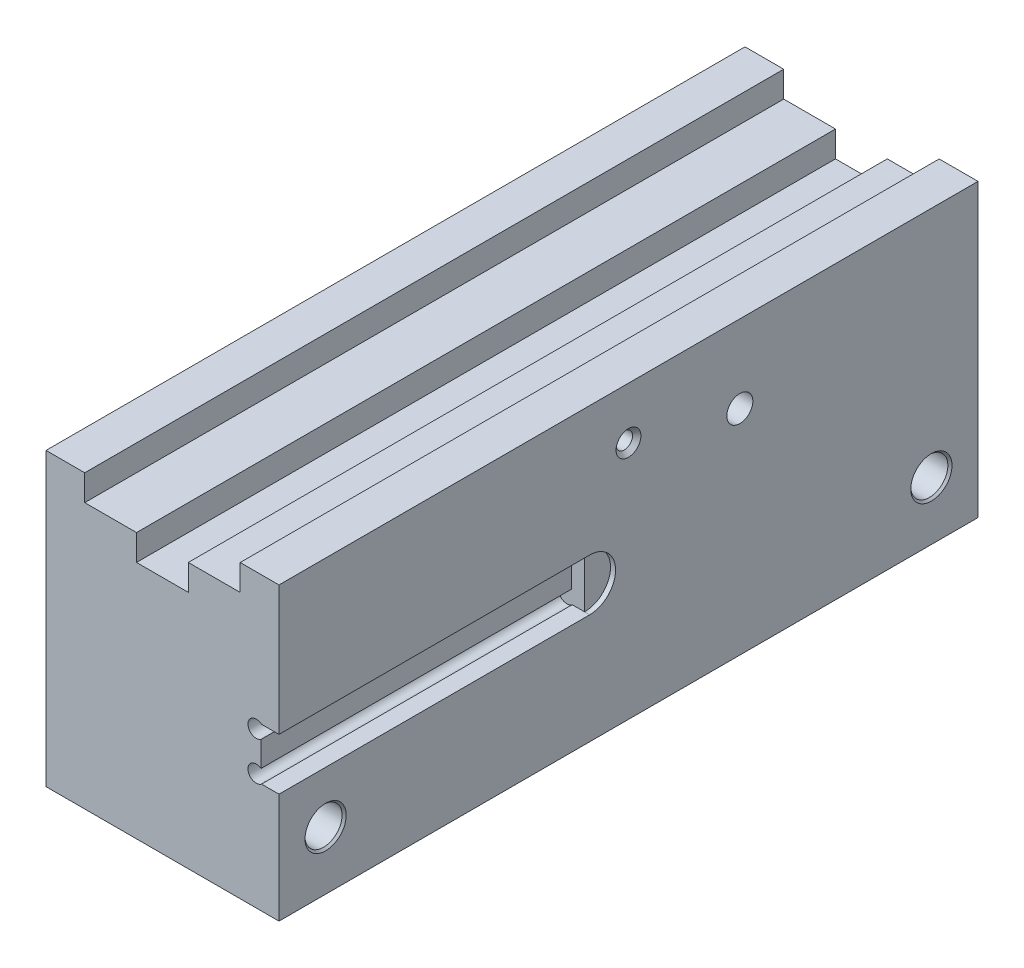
from build123d import *

# Parameters (mm, degrees)
SKETCH1_W                              = 57.15
SKETCH1_H                              = 71.4248
BOSS_EXTRUDE1_DEPTH                    = 171.45
CUT_EXTRUDE1_DEPTH                     = 195.32634164
SKETCH3_R                              = 3.2004
CUT_EXTRUDE2_DEPTH                     = 6.35
F_1_4_20_TAPPED_HOLE1_D                = 5.1054
F_1_4_20_TAPPED_HOLE1_DEPTH            = 11.43
F_1_4_20_TAPPED_HOLE1_CSINK_D          = 7.62
F_1_4_20_TAPPED_HOLE1_CSINK_ANGLE      = 90
F_1_4_20_TAPPED_HOLE1_TIP              = 1.533816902
CUT_EXTRUDE4_DEPTH                     = 76.2
SKETCH10_R                             = 6.35
CUT_EXTRUDE5_DEPTH                     = 1.2319
SKETCH11_R                             = 4.3561
CUT_EXTRUDE6_DEPTH                     = 11.0998
F_1_8_27_NPSM_TAPPED_HOLE1_D           = 9.0932
F_1_8_27_NPSM_TAPPED_HOLE1_DEPTH       = 22.86
F_1_8_27_NPSM_TAPPED_HOLE1_CSINK_D     = 10.1092
F_1_8_27_NPSM_TAPPED_HOLE1_CSINK_ANGLE = 90
F_1_8_27_NPSM_TAPPED_HOLE1_TIP         = 2.73187289
F_1_8_27_NPSM_TAPPED_HOLE2_D           = 9.0932
F_1_8_27_NPSM_TAPPED_HOLE2_DEPTH       = 22.86
F_1_8_27_NPSM_TAPPED_HOLE2_CSINK_D     = 10.1092
F_1_8_27_NPSM_TAPPED_HOLE2_CSINK_ANGLE = 90
F_1_8_27_NPSM_TAPPED_HOLE2_TIP         = 2.73187289
SKETCH16_R                             = 3.19405
CUT_EXTRUDE7_DEPTH                     = 11.0998
F_10_32_TAPPED_HOLE2_D                 = 4.0386
F_10_32_TAPPED_HOLE2_DEPTH             = 11.938
F_10_32_TAPPED_HOLE2_CSINK_D           = 6.096
F_10_32_TAPPED_HOLE2_CSINK_ANGLE       = 90
F_10_32_TAPPED_HOLE2_TIP               = 1.213317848


with BuildPart() as part:
    # Sketch1 → Boss-Extrude1 (new body)
    with BuildSketch(Plane.XY):
        with Locations((28.575, 35.7124)):
            Rectangle(SKETCH1_W, SKETCH1_H)
    extrude(amount=-BOSS_EXTRUDE1_DEPTH)

    # Sketch2 → Cut-Extrude1 (cut, through all)
    with BuildSketch(Plane.XY):
        Polygon((9.4996, 71.4248), (47.625, 71.4248), (47.625, 65.0748), (34.8996, 65.0748), (34.8996, 58.7248), (22.1996, 58.7248), (22.1996, 65.0748), (9.4996, 65.0748), align=None)
    extrude(amount=-CUT_EXTRUDE1_DEPTH, mode=Mode.SUBTRACT)

    # Sketch3 → Cut-Extrude2 (cut)
    with BuildSketch(Plane.XZ):
        with Locations(Location((26.9875, -34.925, 0), (0, 0, 270))):
            Circle(SKETCH3_R)
        with Locations(Location((7.9375, -85.725, 0), (0, 0, 270))):
            Circle(SKETCH3_R)
        with Locations(Location((46.0375, -85.725, 0), (0, 0, 270))):
            Circle(SKETCH3_R)
        with Locations(Location((26.9875, -136.525, 0), (0, 0, 270))):
            Circle(SKETCH3_R)
    extrude(amount=-CUT_EXTRUDE2_DEPTH, mode=Mode.SUBTRACT)

    # 1_4-20 Tapped Hole1
    with Locations(Plane(origin=(0, 0, 0), x_dir=(-1, 0, 0), z_dir=(0, -1, 0))):
        with Locations((-7.9375, 60.325), (-46.0375, 60.325), (-46.0375, 111.125), (-7.9375, 111.125)):
            CounterSinkHole(F_1_4_20_TAPPED_HOLE1_D / 2, F_1_4_20_TAPPED_HOLE1_CSINK_D / 2, depth=F_1_4_20_TAPPED_HOLE1_DEPTH, counter_sink_angle=F_1_4_20_TAPPED_HOLE1_CSINK_ANGLE)
            with Locations((0, 0, -(F_1_4_20_TAPPED_HOLE1_DEPTH + F_1_4_20_TAPPED_HOLE1_TIP / 2))):  # 118° drill point
                Cone(0, F_1_4_20_TAPPED_HOLE1_D / 2, F_1_4_20_TAPPED_HOLE1_TIP, mode=Mode.SUBTRACT)

    # Sketch9 → Cut-Extrude4 (cut)
    with BuildSketch(Plane.XY):
        with BuildLine():
            Line((52.863358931, 39.6748), (57.15, 39.6748))
            Line((57.15, 39.6748), (57.15, 26.9748))
            Line((57.15, 26.9748), (52.863358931, 26.9748))
            ThreePointArc((52.863358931, 26.9748), (49.53138515, 28.487050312), (52.7431, 30.240286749))
            Line((52.7431, 30.240286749), (52.7431, 36.409313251))
            ThreePointArc((52.7431, 36.409313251), (49.53138515, 38.162549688), (52.863358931, 39.6748))
        make_face()
    extrude(amount=-CUT_EXTRUDE4_DEPTH, mode=Mode.SUBTRACT)

    # Sketch10 → Cut-Extrude5 (cut)
    with BuildSketch(Plane(origin=(57.15, 0, 0), x_dir=(0, 0, -1), z_dir=(1, 0, 0))):
        with Locations((76.2, 33.3248)):
            Circle(SKETCH10_R)
    extrude(amount=-CUT_EXTRUDE5_DEPTH, mode=Mode.SUBTRACT)

    # Sketch11 → Cut-Extrude6 (cut)
    with BuildSketch(Plane.XZ):
        with Locations(Location((26.9875, -11.43, 0), (0, 0, 270))):
            Circle(SKETCH11_R)
        with Locations(Location((26.9875, -160.02, 0), (0, 0, 270))):
            Circle(SKETCH11_R)
    extrude(amount=-CUT_EXTRUDE6_DEPTH, mode=Mode.SUBTRACT)

    # 1_8-27 NPSM Tapped Hole1
    with Locations(Plane(origin=(0, 0, 0), x_dir=(-1, 0, 0), z_dir=(0, -1, 0))):
        with Locations((-26.9875, 11.43), (-26.9875, 160.02)):
            CounterSinkHole(F_1_8_27_NPSM_TAPPED_HOLE1_D / 2, F_1_8_27_NPSM_TAPPED_HOLE1_CSINK_D / 2, depth=F_1_8_27_NPSM_TAPPED_HOLE1_DEPTH, counter_sink_angle=F_1_8_27_NPSM_TAPPED_HOLE1_CSINK_ANGLE)
            with Locations((0, 0, -(F_1_8_27_NPSM_TAPPED_HOLE1_DEPTH + F_1_8_27_NPSM_TAPPED_HOLE1_TIP / 2))):  # 118° drill point
                Cone(0, F_1_8_27_NPSM_TAPPED_HOLE1_D / 2, F_1_8_27_NPSM_TAPPED_HOLE1_TIP, mode=Mode.SUBTRACT)

    # 1_8-27 NPSM Tapped Hole2
    with Locations(Plane(origin=(57.15, 0, 0), x_dir=(0, 0, -1), z_dir=(1, 0, 0))):
        with Locations((11.43, 14.2748), (160.02, 14.2748)):
            CounterSinkHole(F_1_8_27_NPSM_TAPPED_HOLE2_D / 2, F_1_8_27_NPSM_TAPPED_HOLE2_CSINK_D / 2, depth=F_1_8_27_NPSM_TAPPED_HOLE2_DEPTH, counter_sink_angle=F_1_8_27_NPSM_TAPPED_HOLE2_CSINK_ANGLE)
            with Locations((0, 0, -(F_1_8_27_NPSM_TAPPED_HOLE2_DEPTH + F_1_8_27_NPSM_TAPPED_HOLE2_TIP / 2))):  # 118° drill point
                Cone(0, F_1_8_27_NPSM_TAPPED_HOLE2_D / 2, F_1_8_27_NPSM_TAPPED_HOLE2_TIP, mode=Mode.SUBTRACT)

    # Sketch16 → Cut-Extrude7 (cut)
    with BuildSketch(Plane(origin=(57.15, 0, 0), x_dir=(0, 0, -1), z_dir=(1, 0, 0))):
        with Locations((113.03, 52.3748)):
            Circle(SKETCH16_R)
    extrude(amount=-CUT_EXTRUDE7_DEPTH, mode=Mode.SUBTRACT)

    # 10-32 Tapped Hole2
    with Locations(Plane(origin=(57.15, 0, 0), x_dir=(0, 0, -1), z_dir=(1, 0, 0))):
        with Locations((85.725, 58.7248)):
            CounterSinkHole(F_10_32_TAPPED_HOLE2_D / 2, F_10_32_TAPPED_HOLE2_CSINK_D / 2, depth=F_10_32_TAPPED_HOLE2_DEPTH, counter_sink_angle=F_10_32_TAPPED_HOLE2_CSINK_ANGLE)
            with Locations((0, 0, -(F_10_32_TAPPED_HOLE2_DEPTH + F_10_32_TAPPED_HOLE2_TIP / 2))):  # 118° drill point
                Cone(0, F_10_32_TAPPED_HOLE2_D / 2, F_10_32_TAPPED_HOLE2_TIP, mode=Mode.SUBTRACT)


solid = part.part
